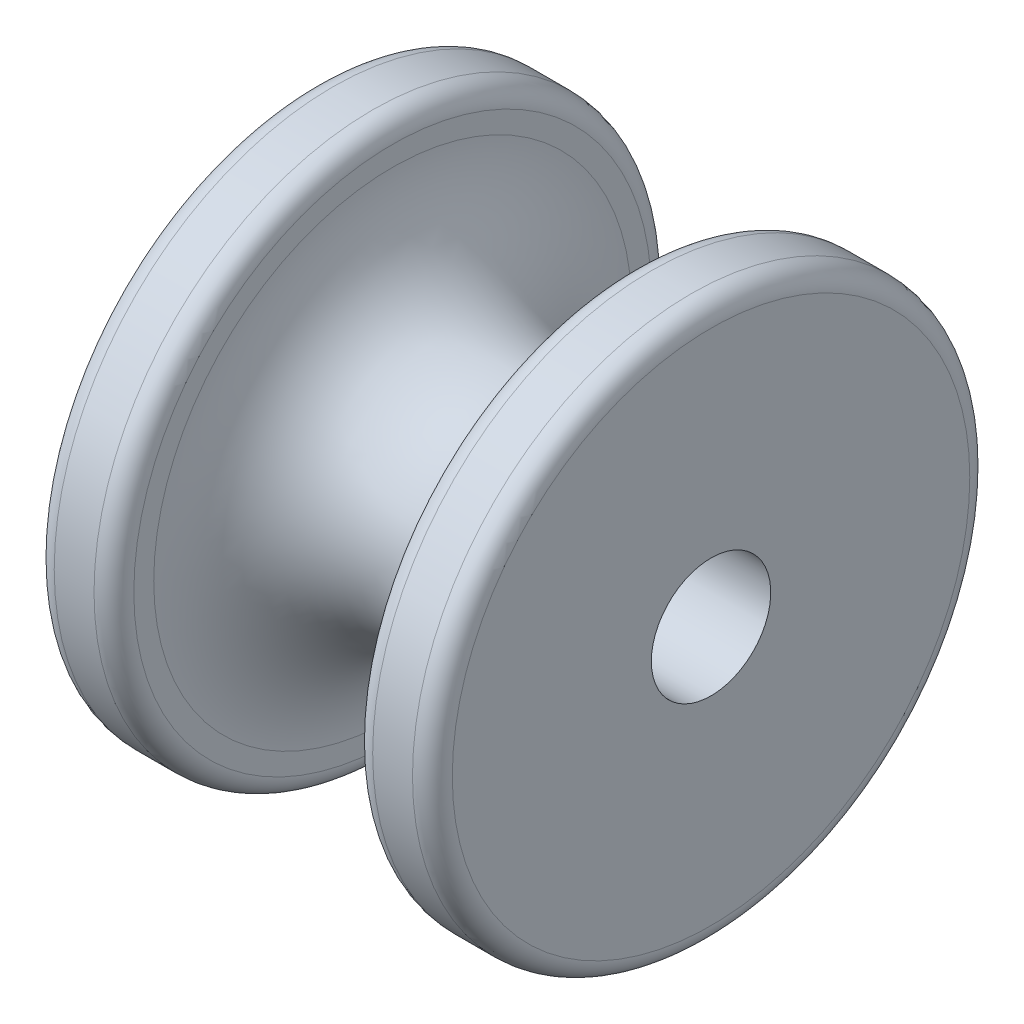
from build123d import *

# Parameters (mm, degrees)
ESQUISSE2_R             = 1.5
ENL_V_MAT_EXTRU_1_DEPTH = 10
ESQUISSE4_R             = 0.5
BOSS_EXTRU_1_DEPTH      = 0.5


with BuildPart() as part:
    # Esquisse1 → R_volution1 (revolve)
    with BuildSketch(Plane.XY, mode=Mode.PRIVATE) as r_volution1_sk:
        with BuildLine():
            Line((-5, 0), (-5, 6.5))
            ThreePointArc((-5, 6.5), (-4.853553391, 6.853553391), (-4.5, 7))
            Line((-4.5, 7), (-3.5, 7))
            ThreePointArc((-3.5, 7), (-3.146446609, 6.853553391), (-3, 6.5))
            Line((-3, 6.5), (-3, 6))
            ThreePointArc((-3, 6), (0, 3), (3, 6))
            Line((3, 6), (3, 6.5))
            ThreePointArc((3, 6.5), (3.146446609, 6.853553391), (3.5, 7))
            Line((3.5, 7), (4.5, 7))
            ThreePointArc((4.5, 7), (4.853553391, 6.853553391), (5, 6.5))
            Line((5, 6.5), (5, 0))
            Line((5, 0), (-5, 0))
        make_face()
    revolve(r_volution1_sk.sketch.rotate(Axis((-15.155672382, 0, 0), (1, 0, 0)), 90), axis=Axis((-15.155672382, 0, 0), (1, 0, 0)))

    # Esquisse2 → Enl_v. mat.-Extru.1 (cut)
    with BuildSketch(Plane.ZY.offset(5)):
        Circle(ESQUISSE2_R)
    extrude(amount=-ENL_V_MAT_EXTRU_1_DEPTH, mode=Mode.SUBTRACT)

    # Esquisse4 → Boss.-Extru.1 (add)
    with BuildSketch(Plane.ZY.offset(5)):
        with Locations(Location((0, 5, 0), (0, 0, 180))):
            Circle(ESQUISSE4_R)
    extrude(amount=BOSS_EXTRU_1_DEPTH)


solid = part.part
